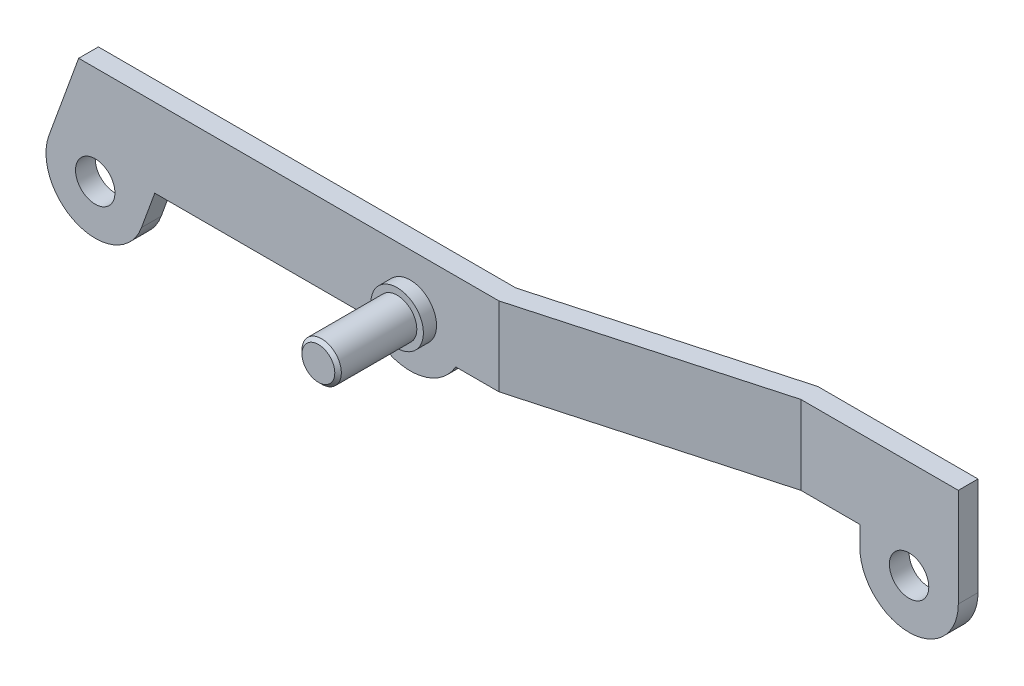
ISO-10303-21;
HEADER;
FILE_DESCRIPTION(('STEP AP214'),'2;1');
FILE_NAME('part.step','',(''),(''),'','','');
FILE_SCHEMA(('AUTOMOTIVE_DESIGN { 1 0 10303 214 1 1 1 1 }'));
ENDSEC;
DATA;
#1=APPLICATION_CONTEXT('core data for automotive mechanical design processes');
#2=APPLICATION_PROTOCOL_DEFINITION('international standard','automotive_design',2000,#1);
#3=PRODUCT_CONTEXT('',#1,'mechanical');
#4=PRODUCT('Part','Part','',(#3));
#5=PRODUCT_RELATED_PRODUCT_CATEGORY('part','',(#4));
#6=PRODUCT_DEFINITION_FORMATION('','',#4);
#7=PRODUCT_DEFINITION_CONTEXT('part definition',#1,'design');
#8=PRODUCT_DEFINITION('design','',#6,#7);
#9=PRODUCT_DEFINITION_SHAPE('','',#8);
#10=(LENGTH_UNIT() NAMED_UNIT(*) SI_UNIT(.MILLI.,.METRE.));
#11=(NAMED_UNIT(*) PLANE_ANGLE_UNIT() SI_UNIT($,.RADIAN.));
#12=(NAMED_UNIT(*) SI_UNIT($,.STERADIAN.) SOLID_ANGLE_UNIT());
#13=UNCERTAINTY_MEASURE_WITH_UNIT(LENGTH_MEASURE(1.E-05),#10,'distance_accuracy_value','');
#14=(GEOMETRIC_REPRESENTATION_CONTEXT(3) GLOBAL_UNCERTAINTY_ASSIGNED_CONTEXT((#13)) GLOBAL_UNIT_ASSIGNED_CONTEXT((#10,
#11,#12)) REPRESENTATION_CONTEXT('',''));
#15=CARTESIAN_POINT('',(0.,0.,0.));
#16=DIRECTION('',(0.,0.,1.));
#17=DIRECTION('',(1.,0.,0.));
#18=AXIS2_PLACEMENT_3D('',#15,#16,#17);
#19=CARTESIAN_POINT('',(0.,0.,1.));
#20=DIRECTION('',(0.,0.,1.));
#21=DIRECTION('',(1.,0.,0.));
#22=AXIS2_PLACEMENT_3D('',#19,#20,#21);
#23=PLANE('',#22);
#24=CARTESIAN_POINT('',(0.,0.,1.));
#25=DIRECTION('',(0.,0.,1.));
#26=DIRECTION('',(1.,0.,0.));
#27=AXIS2_PLACEMENT_3D('',#24,#25,#26);
#28=CIRCLE('',#27,2.);
#29=CARTESIAN_POINT('',(2.,0.,1.));
#30=VERTEX_POINT('',#29);
#31=EDGE_CURVE('E149',#30,#30,#28,.T.);
#32=ORIENTED_EDGE('',*,*,#31,.T.);
#33=EDGE_LOOP('',(#32));
#34=FACE_BOUND('',#33,.T.);
#35=CARTESIAN_POINT('',(0.,0.,1.));
#36=DIRECTION('',(0.,0.,1.));
#37=DIRECTION('',(1.,0.,0.));
#38=AXIS2_PLACEMENT_3D('',#35,#36,#37);
#39=CIRCLE('',#38,1.5);
#40=CARTESIAN_POINT('',(1.5,0.,1.));
#41=VERTEX_POINT('',#40);
#42=EDGE_CURVE('E141',#41,#41,#39,.T.);
#43=ORIENTED_EDGE('',*,*,#42,.F.);
#44=EDGE_LOOP('',(#43));
#45=FACE_BOUND('',#44,.T.);
#46=ADVANCED_FACE('F17',(#34,#45),#23,.T.);
#47=CARTESIAN_POINT('',(-19.463378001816,-2.,-6.5));
#48=DIRECTION('',(0.,-1.,0.));
#49=DIRECTION('',(0.,0.,-1.));
#50=AXIS2_PLACEMENT_3D('',#47,#48,#49);
#51=PLANE('',#50);
#52=DIRECTION('',(0.,0.,1.));
#53=VECTOR('',#52,1.);
#54=CARTESIAN_POINT('',(3.46410161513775,-2.,-10.4442719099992));
#55=LINE('',#54,#53);
#56=CARTESIAN_POINT('',(3.46410161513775,-2.,-1.5));
#57=VERTEX_POINT('',#56);
#58=CARTESIAN_POINT('',(3.46410161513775,-2.,0.));
#59=VERTEX_POINT('',#58);
#60=EDGE_CURVE('E134',#57,#59,#55,.T.);
#61=ORIENTED_EDGE('',*,*,#60,.F.);
#62=DIRECTION('',(1.,0.,0.));
#63=VECTOR('',#62,1.);
#64=CARTESIAN_POINT('',(-19.463378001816,-2.,-1.5));
#65=LINE('',#64,#63);
#66=CARTESIAN_POINT('',(6.54553749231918,-2.,-1.5));
#67=VERTEX_POINT('',#66);
#68=EDGE_CURVE('E125',#57,#67,#65,.T.);
#69=ORIENTED_EDGE('',*,*,#68,.T.);
#70=DIRECTION('',(0.963517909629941,0.,-0.267643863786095));
#71=VECTOR('',#70,1.);
#72=CARTESIAN_POINT('',(-16.3108768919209,-2.,4.84900399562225));
#73=LINE('',#72,#71);
#74=CARTESIAN_POINT('',(24.5455374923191,-2.,-6.5));
#75=VERTEX_POINT('',#74);
#76=EDGE_CURVE('E189',#67,#75,#73,.T.);
#77=ORIENTED_EDGE('',*,*,#76,.T.);
#78=DIRECTION('',(1.,0.,0.));
#79=VECTOR('',#78,1.);
#80=CARTESIAN_POINT('',(-19.463378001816,-2.,-6.5));
#81=LINE('',#80,#79);
#82=CARTESIAN_POINT('',(29.25,-2.,-6.5));
#83=VERTEX_POINT('',#82);
#84=EDGE_CURVE('E212',#75,#83,#81,.T.);
#85=ORIENTED_EDGE('',*,*,#84,.T.);
#86=DIRECTION('',(0.,0.,1.));
#87=VECTOR('',#86,1.);
#88=CARTESIAN_POINT('',(29.25,-2.,-6.5));
#89=LINE('',#88,#87);
#90=CARTESIAN_POINT('',(29.25,-2.,-5.));
#91=VERTEX_POINT('',#90);
#92=EDGE_CURVE('E239',#83,#91,#89,.T.);
#93=ORIENTED_EDGE('',*,*,#92,.T.);
#94=DIRECTION('',(-1.,0.,0.));
#95=VECTOR('',#94,1.);
#96=CARTESIAN_POINT('',(-19.463378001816,-2.,-5.));
#97=LINE('',#96,#95);
#98=CARTESIAN_POINT('',(24.75,-2.,-5.));
#99=VERTEX_POINT('',#98);
#100=EDGE_CURVE('E169',#91,#99,#97,.T.);
#101=ORIENTED_EDGE('',*,*,#100,.T.);
#102=DIRECTION('',(-0.963517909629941,0.,0.267643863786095));
#103=VECTOR('',#102,1.);
#104=CARTESIAN_POINT('',(-15.9094110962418,-2.,6.29428086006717));
#105=LINE('',#104,#103);
#106=CARTESIAN_POINT('',(6.75,-2.,0.));
#107=VERTEX_POINT('',#106);
#108=EDGE_CURVE('E187',#99,#107,#105,.T.);
#109=ORIENTED_EDGE('',*,*,#108,.T.);
#110=DIRECTION('',(1.,0.,0.));
#111=VECTOR('',#110,1.);
#112=CARTESIAN_POINT('',(-19.463378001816,-2.,0.));
#113=LINE('',#112,#111);
#114=EDGE_CURVE('E32',#59,#107,#113,.T.);
#115=ORIENTED_EDGE('',*,*,#114,.F.);
#116=EDGE_LOOP('',(#61,#69,#77,#85,#93,#101,#109,#115));
#117=FACE_BOUND('',#116,.T.);
#118=ADVANCED_FACE('F270',(#117),#51,.T.);
#119=CARTESIAN_POINT('',(-25.2608898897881,4.,-6.5));
#120=DIRECTION('',(-0.939692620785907,0.342020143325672,0.));
#121=DIRECTION('',(-0.342020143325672,-0.939692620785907,0.));
#122=AXIS2_PLACEMENT_3D('',#119,#120,#121);
#123=PLANE('',#122);
#124=DIRECTION('',(0.,0.,1.));
#125=VECTOR('',#124,1.);
#126=CARTESIAN_POINT('',(-25.2608898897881,4.,-6.5));
#127=LINE('',#126,#125);
#128=CARTESIAN_POINT('',(-25.2608898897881,4.,-1.5));
#129=VERTEX_POINT('',#128);
#130=CARTESIAN_POINT('',(-25.2608898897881,4.,0.));
#131=VERTEX_POINT('',#130);
#132=EDGE_CURVE('E227',#129,#131,#127,.T.);
#133=ORIENTED_EDGE('',*,*,#132,.F.);
#134=DIRECTION('',(-0.342020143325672,-0.939692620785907,0.));
#135=VECTOR('',#134,1.);
#136=CARTESIAN_POINT('',(-25.2608898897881,4.,-1.5));
#137=LINE('',#136,#135);
#138=CARTESIAN_POINT('',(-27.5238473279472,-2.21742446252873,-1.5));
#139=VERTEX_POINT('',#138);
#140=EDGE_CURVE('E124',#129,#139,#137,.T.);
#141=ORIENTED_EDGE('',*,*,#140,.T.);
#142=DIRECTION('',(0.,0.,1.));
#143=VECTOR('',#142,1.);
#144=CARTESIAN_POINT('',(-27.5238473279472,-2.21742446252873,-6.5));
#145=LINE('',#144,#143);
#146=CARTESIAN_POINT('',(-27.5238473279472,-2.21742446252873,0.));
#147=VERTEX_POINT('',#146);
#148=EDGE_CURVE('E226',#139,#147,#145,.T.);
#149=ORIENTED_EDGE('',*,*,#148,.T.);
#150=DIRECTION('',(-0.342020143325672,-0.939692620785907,0.));
#151=VECTOR('',#150,1.);
#152=CARTESIAN_POINT('',(-25.2608898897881,4.,0.));
#153=LINE('',#152,#151);
#154=EDGE_CURVE('E198',#131,#147,#153,.T.);
#155=ORIENTED_EDGE('',*,*,#154,.F.);
#156=EDGE_LOOP('',(#133,#141,#149,#155));
#157=FACE_BOUND('',#156,.T.);
#158=ADVANCED_FACE('F19',(#157),#123,.T.);
#159=CARTESIAN_POINT('',(-25.2608898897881,4.,-6.5));
#160=DIRECTION('',(0.,1.,0.));
#161=DIRECTION('',(0.,0.,1.));
#162=AXIS2_PLACEMENT_3D('',#159,#160,#161);
#163=PLANE('',#162);
#164=DIRECTION('',(0.963517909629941,0.,-0.267643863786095));
#165=VECTOR('',#164,1.);
#166=CARTESIAN_POINT('',(24.75,4.,-5.));
#167=LINE('',#166,#165);
#168=CARTESIAN_POINT('',(6.75,4.,0.));
#169=VERTEX_POINT('',#168);
#170=CARTESIAN_POINT('',(24.75,4.,-5.));
#171=VERTEX_POINT('',#170);
#172=EDGE_CURVE('E158',#169,#171,#167,.T.);
#173=ORIENTED_EDGE('',*,*,#172,.T.);
#174=DIRECTION('',(1.,0.,0.));
#175=VECTOR('',#174,1.);
#176=CARTESIAN_POINT('',(41.75,4.,-5.));
#177=LINE('',#176,#175);
#178=CARTESIAN_POINT('',(36.75,4.,-5.));
#179=VERTEX_POINT('',#178);
#180=EDGE_CURVE('E161',#171,#179,#177,.T.);
#181=ORIENTED_EDGE('',*,*,#180,.T.);
#182=DIRECTION('',(0.,0.,1.));
#183=VECTOR('',#182,1.);
#184=CARTESIAN_POINT('',(36.75,4.,-6.5));
#185=LINE('',#184,#183);
#186=CARTESIAN_POINT('',(36.75,4.,-6.5));
#187=VERTEX_POINT('',#186);
#188=EDGE_CURVE('E230',#187,#179,#185,.T.);
#189=ORIENTED_EDGE('',*,*,#188,.F.);
#190=DIRECTION('',(-1.,0.,0.));
#191=VECTOR('',#190,1.);
#192=CARTESIAN_POINT('',(-25.2608898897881,4.,-6.5));
#193=LINE('',#192,#191);
#194=CARTESIAN_POINT('',(24.5455374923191,4.,-6.5));
#195=VERTEX_POINT('',#194);
#196=EDGE_CURVE('E223',#187,#195,#193,.T.);
#197=ORIENTED_EDGE('',*,*,#196,.T.);
#198=DIRECTION('',(-0.963517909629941,0.,0.267643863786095));
#199=VECTOR('',#198,1.);
#200=CARTESIAN_POINT('',(37.1455374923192,4.,-10.));
#201=LINE('',#200,#199);
#202=CARTESIAN_POINT('',(6.54553749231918,4.,-1.5));
#203=VERTEX_POINT('',#202);
#204=EDGE_CURVE('E152',#195,#203,#201,.T.);
#205=ORIENTED_EDGE('',*,*,#204,.T.);
#206=DIRECTION('',(-1.,0.,0.));
#207=VECTOR('',#206,1.);
#208=CARTESIAN_POINT('',(6.54553749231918,4.,-1.5));
#209=LINE('',#208,#207);
#210=EDGE_CURVE('E155',#203,#129,#209,.T.);
#211=ORIENTED_EDGE('',*,*,#210,.T.);
#212=ORIENTED_EDGE('',*,*,#132,.T.);
#213=DIRECTION('',(-1.,0.,0.));
#214=VECTOR('',#213,1.);
#215=CARTESIAN_POINT('',(-25.2608898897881,4.,0.));
#216=LINE('',#215,#214);
#217=EDGE_CURVE('E209',#169,#131,#216,.T.);
#218=ORIENTED_EDGE('',*,*,#217,.F.);
#219=EDGE_LOOP('',(#173,#181,#189,#197,#205,#211,#212,#218));
#220=FACE_BOUND('',#219,.T.);
#221=ADVANCED_FACE('F316',(#220),#163,.T.);
#222=CARTESIAN_POINT('',(36.75,4.,-6.5));
#223=DIRECTION('',(1.,0.,0.));
#224=DIRECTION('',(0.,0.,-1.));
#225=AXIS2_PLACEMENT_3D('',#222,#223,#224);
#226=PLANE('',#225);
#227=ORIENTED_EDGE('',*,*,#188,.T.);
#228=DIRECTION('',(0.,-1.,0.));
#229=VECTOR('',#228,1.);
#230=CARTESIAN_POINT('',(36.75,4.,-5.));
#231=LINE('',#230,#229);
#232=CARTESIAN_POINT('',(36.75,-3.5,-5.));
#233=VERTEX_POINT('',#232);
#234=EDGE_CURVE('E177',#179,#233,#231,.T.);
#235=ORIENTED_EDGE('',*,*,#234,.T.);
#236=DIRECTION('',(0.,0.,1.));
#237=VECTOR('',#236,1.);
#238=CARTESIAN_POINT('',(36.75,-3.5,-6.5));
#239=LINE('',#238,#237);
#240=CARTESIAN_POINT('',(36.75,-3.5,-6.5));
#241=VERTEX_POINT('',#240);
#242=EDGE_CURVE('E233',#241,#233,#239,.T.);
#243=ORIENTED_EDGE('',*,*,#242,.F.);
#244=DIRECTION('',(0.,1.,0.));
#245=VECTOR('',#244,1.);
#246=CARTESIAN_POINT('',(36.75,4.,-6.5));
#247=LINE('',#246,#245);
#248=EDGE_CURVE('E220',#241,#187,#247,.T.);
#249=ORIENTED_EDGE('',*,*,#248,.T.);
#250=EDGE_LOOP('',(#227,#235,#243,#249));
#251=FACE_BOUND('',#250,.T.);
#252=ADVANCED_FACE('F319',(#251),#226,.T.);
#253=CARTESIAN_POINT('',(33.,-3.5,-6.5));
#254=DIRECTION('',(0.,0.,1.));
#255=DIRECTION('',(1.,0.,0.));
#256=AXIS2_PLACEMENT_3D('',#253,#254,#255);
#257=CYLINDRICAL_SURFACE('',#256,3.75);
#258=CARTESIAN_POINT('',(33.,-3.5,-5.));
#259=DIRECTION('',(0.,0.,1.));
#260=DIRECTION('',(1.,0.,0.));
#261=AXIS2_PLACEMENT_3D('',#258,#259,#260);
#262=CIRCLE('',#261,3.75);
#263=CARTESIAN_POINT('',(29.25,-3.5,-5.));
#264=VERTEX_POINT('',#263);
#265=EDGE_CURVE('E175',#233,#264,#262,.F.);
#266=ORIENTED_EDGE('',*,*,#265,.T.);
#267=DIRECTION('',(0.,0.,1.));
#268=VECTOR('',#267,1.);
#269=CARTESIAN_POINT('',(29.25,-3.5,-6.5));
#270=LINE('',#269,#268);
#271=CARTESIAN_POINT('',(29.25,-3.5,-6.5));
#272=VERTEX_POINT('',#271);
#273=EDGE_CURVE('E236',#272,#264,#270,.T.);
#274=ORIENTED_EDGE('',*,*,#273,.F.);
#275=CARTESIAN_POINT('',(33.,-3.5,-6.5));
#276=DIRECTION('',(0.,0.,1.));
#277=DIRECTION('',(1.,0.,0.));
#278=AXIS2_PLACEMENT_3D('',#275,#276,#277);
#279=CIRCLE('',#278,3.75);
#280=EDGE_CURVE('E217',#272,#241,#279,.T.);
#281=ORIENTED_EDGE('',*,*,#280,.T.);
#282=ORIENTED_EDGE('',*,*,#242,.T.);
#283=EDGE_LOOP('',(#266,#274,#281,#282));
#284=FACE_BOUND('',#283,.T.);
#285=ADVANCED_FACE('F323',(#284),#257,.T.);
#286=CARTESIAN_POINT('',(29.25,-2.,-6.5));
#287=DIRECTION('',(-1.,0.,0.));
#288=DIRECTION('',(0.,0.,1.));
#289=AXIS2_PLACEMENT_3D('',#286,#287,#288);
#290=PLANE('',#289);
#291=ORIENTED_EDGE('',*,*,#273,.T.);
#292=DIRECTION('',(0.,1.,0.));
#293=VECTOR('',#292,1.);
#294=CARTESIAN_POINT('',(29.25,-2.,-5.));
#295=LINE('',#294,#293);
#296=EDGE_CURVE('E172',#264,#91,#295,.T.);
#297=ORIENTED_EDGE('',*,*,#296,.T.);
#298=ORIENTED_EDGE('',*,*,#92,.F.);
#299=DIRECTION('',(0.,-1.,0.));
#300=VECTOR('',#299,1.);
#301=CARTESIAN_POINT('',(29.25,-2.,-6.5));
#302=LINE('',#301,#300);
#303=EDGE_CURVE('E214',#83,#272,#302,.T.);
#304=ORIENTED_EDGE('',*,*,#303,.T.);
#305=EDGE_LOOP('',(#291,#297,#298,#304));
#306=FACE_BOUND('',#305,.T.);
#307=ADVANCED_FACE('F327',(#306),#290,.T.);
#308=DIRECTION('',(0.,0.,1.));
#309=VECTOR('',#308,1.);
#310=CARTESIAN_POINT('',(-3.46410161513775,-2.,-10.4442719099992));
#311=LINE('',#310,#309);
#312=CARTESIAN_POINT('',(-3.46410161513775,-2.,0.));
#313=VERTEX_POINT('',#312);
#314=CARTESIAN_POINT('',(-3.46410161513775,-2.,-1.5));
#315=VERTEX_POINT('',#314);
#316=EDGE_CURVE('E40',#313,#315,#311,.F.);
#317=ORIENTED_EDGE('',*,*,#316,.F.);
#318=CARTESIAN_POINT('',(-19.463378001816,-2.,0.));
#319=VERTEX_POINT('',#318);
#320=EDGE_CURVE('E207',#319,#313,#113,.T.);
#321=ORIENTED_EDGE('',*,*,#320,.F.);
#322=DIRECTION('',(0.,0.,1.));
#323=VECTOR('',#322,1.);
#324=CARTESIAN_POINT('',(-19.463378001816,-2.,-6.5));
#325=LINE('',#324,#323);
#326=CARTESIAN_POINT('',(-19.463378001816,-2.,-1.5));
#327=VERTEX_POINT('',#326);
#328=EDGE_CURVE('E119',#327,#319,#325,.T.);
#329=ORIENTED_EDGE('',*,*,#328,.F.);
#330=EDGE_CURVE('E117',#327,#315,#65,.T.);
#331=ORIENTED_EDGE('',*,*,#330,.T.);
#332=EDGE_LOOP('',(#317,#321,#329,#331));
#333=FACE_BOUND('',#332,.T.);
#334=ADVANCED_FACE('F118',(#333),#51,.T.);
#335=CARTESIAN_POINT('',(-19.463378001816,-2.,-6.5));
#336=DIRECTION('',(0.939692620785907,-0.342020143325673,0.));
#337=DIRECTION('',(0.342020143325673,0.939692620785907,0.));
#338=AXIS2_PLACEMENT_3D('',#335,#336,#337);
#339=PLANE('',#338);
#340=DIRECTION('',(0.,0.,1.));
#341=VECTOR('',#340,1.);
#342=CARTESIAN_POINT('',(-20.4761526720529,-4.78257553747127,-6.5));
#343=LINE('',#342,#341);
#344=CARTESIAN_POINT('',(-20.4761526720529,-4.78257553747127,-1.5));
#345=VERTEX_POINT('',#344);
#346=CARTESIAN_POINT('',(-20.4761526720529,-4.78257553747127,0.));
#347=VERTEX_POINT('',#346);
#348=EDGE_CURVE('E243',#345,#347,#343,.T.);
#349=ORIENTED_EDGE('',*,*,#348,.F.);
#350=DIRECTION('',(0.342020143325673,0.939692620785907,0.));
#351=VECTOR('',#350,1.);
#352=CARTESIAN_POINT('',(-19.463378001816,-2.,-1.5));
#353=LINE('',#352,#351);
#354=EDGE_CURVE('E183',#345,#327,#353,.T.);
#355=ORIENTED_EDGE('',*,*,#354,.T.);
#356=ORIENTED_EDGE('',*,*,#328,.T.);
#357=DIRECTION('',(0.342020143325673,0.939692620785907,0.));
#358=VECTOR('',#357,1.);
#359=CARTESIAN_POINT('',(-19.463378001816,-2.,0.));
#360=LINE('',#359,#358);
#361=EDGE_CURVE('E204',#347,#319,#360,.T.);
#362=ORIENTED_EDGE('',*,*,#361,.F.);
#363=EDGE_LOOP('',(#349,#355,#356,#362));
#364=FACE_BOUND('',#363,.T.);
#365=ADVANCED_FACE('F333',(#364),#339,.T.);
#366=CARTESIAN_POINT('',(-24.,-3.5,-6.5));
#367=DIRECTION('',(0.,0.,1.));
#368=DIRECTION('',(1.,0.,0.));
#369=AXIS2_PLACEMENT_3D('',#366,#367,#368);
#370=CYLINDRICAL_SURFACE('',#369,3.75);
#371=CARTESIAN_POINT('',(-24.,-3.5,-1.5));
#372=DIRECTION('',(0.,0.,-1.));
#373=DIRECTION('',(-1.,0.,0.));
#374=AXIS2_PLACEMENT_3D('',#371,#372,#373);
#375=CIRCLE('',#374,3.75);
#376=EDGE_CURVE('E181',#139,#345,#375,.F.);
#377=ORIENTED_EDGE('',*,*,#376,.T.);
#378=ORIENTED_EDGE('',*,*,#348,.T.);
#379=CARTESIAN_POINT('',(-24.,-3.5,0.));
#380=DIRECTION('',(0.,0.,1.));
#381=DIRECTION('',(1.,0.,0.));
#382=AXIS2_PLACEMENT_3D('',#379,#380,#381);
#383=CIRCLE('',#382,3.75);
#384=EDGE_CURVE('E201',#147,#347,#383,.T.);
#385=ORIENTED_EDGE('',*,*,#384,.F.);
#386=ORIENTED_EDGE('',*,*,#148,.F.);
#387=EDGE_LOOP('',(#377,#378,#385,#386));
#388=FACE_BOUND('',#387,.T.);
#389=ADVANCED_FACE('F314',(#388),#370,.T.);
#390=CARTESIAN_POINT('',(-24.,-3.5,-6.5));
#391=DIRECTION('',(0.,0.,1.));
#392=DIRECTION('',(1.,0.,0.));
#393=AXIS2_PLACEMENT_3D('',#390,#391,#392);
#394=PLANE('',#393);
#395=CARTESIAN_POINT('',(33.,-3.5,-6.5));
#396=DIRECTION('',(0.,0.,1.));
#397=DIRECTION('',(1.,0.,0.));
#398=AXIS2_PLACEMENT_3D('',#395,#396,#397);
#399=CIRCLE('',#398,1.5);
#400=CARTESIAN_POINT('',(34.5,-3.5,-6.5));
#401=VERTEX_POINT('',#400);
#402=EDGE_CURVE('E192',#401,#401,#399,.T.);
#403=ORIENTED_EDGE('',*,*,#402,.T.);
#404=EDGE_LOOP('',(#403));
#405=FACE_BOUND('',#404,.T.);
#406=DIRECTION('',(0.,-1.,0.));
#407=VECTOR('',#406,1.);
#408=CARTESIAN_POINT('',(24.5455374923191,-3.5,-6.5));
#409=LINE('',#408,#407);
#410=EDGE_CURVE('E252',#195,#75,#409,.T.);
#411=ORIENTED_EDGE('',*,*,#410,.F.);
#412=ORIENTED_EDGE('',*,*,#196,.F.);
#413=ORIENTED_EDGE('',*,*,#248,.F.);
#414=ORIENTED_EDGE('',*,*,#280,.F.);
#415=ORIENTED_EDGE('',*,*,#303,.F.);
#416=ORIENTED_EDGE('',*,*,#84,.F.);
#417=EDGE_LOOP('',(#411,#412,#413,#414,#415,#416));
#418=FACE_BOUND('',#417,.T.);
#419=ADVANCED_FACE('F310',(#405,#418),#394,.F.);
#420=CARTESIAN_POINT('',(-24.,-3.5,0.));
#421=DIRECTION('',(0.,0.,1.));
#422=DIRECTION('',(1.,0.,0.));
#423=AXIS2_PLACEMENT_3D('',#420,#421,#422);
#424=PLANE('',#423);
#425=CARTESIAN_POINT('',(0.,0.,0.));
#426=DIRECTION('',(0.,0.,1.));
#427=DIRECTION('',(1.,0.,0.));
#428=AXIS2_PLACEMENT_3D('',#425,#426,#427);
#429=CIRCLE('',#428,4.);
#430=EDGE_CURVE('E133',#313,#59,#429,.T.);
#431=ORIENTED_EDGE('',*,*,#430,.T.);
#432=ORIENTED_EDGE('',*,*,#114,.T.);
#433=DIRECTION('',(0.,1.,0.));
#434=VECTOR('',#433,1.);
#435=CARTESIAN_POINT('',(6.75,-3.5,0.));
#436=LINE('',#435,#434);
#437=EDGE_CURVE('E229',#107,#169,#436,.T.);
#438=ORIENTED_EDGE('',*,*,#437,.T.);
#439=ORIENTED_EDGE('',*,*,#217,.T.);
#440=ORIENTED_EDGE('',*,*,#154,.T.);
#441=ORIENTED_EDGE('',*,*,#384,.T.);
#442=ORIENTED_EDGE('',*,*,#361,.T.);
#443=ORIENTED_EDGE('',*,*,#320,.T.);
#444=EDGE_LOOP('',(#431,#432,#438,#439,#440,#441,#442,#443));
#445=FACE_BOUND('',#444,.T.);
#446=CARTESIAN_POINT('',(0.,0.,0.));
#447=DIRECTION('',(0.,0.,1.));
#448=DIRECTION('',(1.,0.,0.));
#449=AXIS2_PLACEMENT_3D('',#446,#447,#448);
#450=CIRCLE('',#449,2.);
#451=CARTESIAN_POINT('',(2.,0.,0.));
#452=VERTEX_POINT('',#451);
#453=EDGE_CURVE('E146',#452,#452,#450,.T.);
#454=ORIENTED_EDGE('',*,*,#453,.F.);
#455=EDGE_LOOP('',(#454));
#456=FACE_BOUND('',#455,.T.);
#457=CARTESIAN_POINT('',(-24.,-3.5,0.));
#458=DIRECTION('',(0.,0.,1.));
#459=DIRECTION('',(1.,0.,0.));
#460=AXIS2_PLACEMENT_3D('',#457,#458,#459);
#461=CIRCLE('',#460,1.5);
#462=CARTESIAN_POINT('',(-22.5,-3.5,0.));
#463=VERTEX_POINT('',#462);
#464=EDGE_CURVE('E195',#463,#463,#461,.T.);
#465=ORIENTED_EDGE('',*,*,#464,.F.);
#466=EDGE_LOOP('',(#465));
#467=FACE_BOUND('',#466,.T.);
#468=ADVANCED_FACE('F306',(#445,#456,#467),#424,.T.);
#469=CARTESIAN_POINT('',(-24.,-3.5,-6.5));
#470=DIRECTION('',(0.,0.,1.));
#471=DIRECTION('',(1.,0.,0.));
#472=AXIS2_PLACEMENT_3D('',#469,#470,#471);
#473=CYLINDRICAL_SURFACE('',#472,1.5);
#474=ORIENTED_EDGE('',*,*,#464,.T.);
#475=EDGE_LOOP('',(#474));
#476=FACE_BOUND('',#475,.T.);
#477=CARTESIAN_POINT('',(-24.,-3.5,-1.5));
#478=DIRECTION('',(0.,0.,-1.));
#479=DIRECTION('',(-1.,0.,0.));
#480=AXIS2_PLACEMENT_3D('',#477,#478,#479);
#481=CIRCLE('',#480,1.5);
#482=CARTESIAN_POINT('',(-25.5,-3.5,-1.5));
#483=VERTEX_POINT('',#482);
#484=EDGE_CURVE('E180',#483,#483,#481,.F.);
#485=ORIENTED_EDGE('',*,*,#484,.F.);
#486=EDGE_LOOP('',(#485));
#487=FACE_BOUND('',#486,.T.);
#488=ADVANCED_FACE('F302',(#476,#487),#473,.F.);
#489=CARTESIAN_POINT('',(33.,-3.5,-6.5));
#490=DIRECTION('',(0.,0.,1.));
#491=DIRECTION('',(1.,0.,0.));
#492=AXIS2_PLACEMENT_3D('',#489,#490,#491);
#493=CYLINDRICAL_SURFACE('',#492,1.5);
#494=ORIENTED_EDGE('',*,*,#402,.F.);
#495=EDGE_LOOP('',(#494));
#496=FACE_BOUND('',#495,.T.);
#497=CARTESIAN_POINT('',(33.,-3.5,-5.));
#498=DIRECTION('',(0.,0.,1.));
#499=DIRECTION('',(1.,0.,0.));
#500=AXIS2_PLACEMENT_3D('',#497,#498,#499);
#501=CIRCLE('',#500,1.5);
#502=CARTESIAN_POINT('',(34.5,-3.5,-5.));
#503=VERTEX_POINT('',#502);
#504=EDGE_CURVE('E167',#503,#503,#501,.F.);
#505=ORIENTED_EDGE('',*,*,#504,.F.);
#506=EDGE_LOOP('',(#505));
#507=FACE_BOUND('',#506,.T.);
#508=ADVANCED_FACE('F290',(#496,#507),#493,.F.);
#509=CARTESIAN_POINT('',(41.75,-7.25,-5.));
#510=DIRECTION('',(0.,0.,1.));
#511=DIRECTION('',(1.,0.,0.));
#512=AXIS2_PLACEMENT_3D('',#509,#510,#511);
#513=PLANE('',#512);
#514=ORIENTED_EDGE('',*,*,#180,.F.);
#515=DIRECTION('',(0.,1.,0.));
#516=VECTOR('',#515,1.);
#517=CARTESIAN_POINT('',(24.75,-7.25,-5.));
#518=LINE('',#517,#516);
#519=EDGE_CURVE('E165',#99,#171,#518,.T.);
#520=ORIENTED_EDGE('',*,*,#519,.F.);
#521=ORIENTED_EDGE('',*,*,#100,.F.);
#522=ORIENTED_EDGE('',*,*,#296,.F.);
#523=ORIENTED_EDGE('',*,*,#265,.F.);
#524=ORIENTED_EDGE('',*,*,#234,.F.);
#525=EDGE_LOOP('',(#514,#520,#521,#522,#523,#524));
#526=FACE_BOUND('',#525,.T.);
#527=ORIENTED_EDGE('',*,*,#504,.T.);
#528=EDGE_LOOP('',(#527));
#529=FACE_BOUND('',#528,.T.);
#530=ADVANCED_FACE('F286',(#526,#529),#513,.T.);
#531=CARTESIAN_POINT('',(24.75,-7.25,-5.));
#532=DIRECTION('',(0.267643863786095,0.,0.963517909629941));
#533=DIRECTION('',(0.963517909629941,0.,-0.267643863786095));
#534=AXIS2_PLACEMENT_3D('',#531,#532,#533);
#535=PLANE('',#534);
#536=ORIENTED_EDGE('',*,*,#519,.T.);
#537=ORIENTED_EDGE('',*,*,#172,.F.);
#538=ORIENTED_EDGE('',*,*,#437,.F.);
#539=ORIENTED_EDGE('',*,*,#108,.F.);
#540=EDGE_LOOP('',(#536,#537,#538,#539));
#541=FACE_BOUND('',#540,.T.);
#542=ADVANCED_FACE('F289',(#541),#535,.T.);
#543=CARTESIAN_POINT('',(6.54553749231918,-7.25,-1.5));
#544=DIRECTION('',(0.,0.,-1.));
#545=DIRECTION('',(-1.,0.,0.));
#546=AXIS2_PLACEMENT_3D('',#543,#544,#545);
#547=PLANE('',#546);
#548=ORIENTED_EDGE('',*,*,#68,.F.);
#549=CARTESIAN_POINT('',(0.,0.,-1.5));
#550=DIRECTION('',(0.,0.,-1.));
#551=DIRECTION('',(-1.,0.,0.));
#552=AXIS2_PLACEMENT_3D('',#549,#550,#551);
#553=CIRCLE('',#552,4.);
#554=EDGE_CURVE('E131',#315,#57,#553,.F.);
#555=ORIENTED_EDGE('',*,*,#554,.F.);
#556=ORIENTED_EDGE('',*,*,#330,.F.);
#557=ORIENTED_EDGE('',*,*,#354,.F.);
#558=ORIENTED_EDGE('',*,*,#376,.F.);
#559=ORIENTED_EDGE('',*,*,#140,.F.);
#560=ORIENTED_EDGE('',*,*,#210,.F.);
#561=DIRECTION('',(0.,1.,0.));
#562=VECTOR('',#561,1.);
#563=CARTESIAN_POINT('',(6.54553749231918,-7.25,-1.5));
#564=LINE('',#563,#562);
#565=EDGE_CURVE('E164',#67,#203,#564,.T.);
#566=ORIENTED_EDGE('',*,*,#565,.F.);
#567=EDGE_LOOP('',(#548,#555,#556,#557,#558,#559,#560,#566));
#568=FACE_BOUND('',#567,.T.);
#569=ORIENTED_EDGE('',*,*,#484,.T.);
#570=EDGE_LOOP('',(#569));
#571=FACE_BOUND('',#570,.T.);
#572=ADVANCED_FACE('F137',(#568,#571),#547,.T.);
#573=CARTESIAN_POINT('',(37.1455374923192,-7.25,-10.));
#574=DIRECTION('',(-0.267643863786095,0.,-0.963517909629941));
#575=DIRECTION('',(-0.963517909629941,0.,0.267643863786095));
#576=AXIS2_PLACEMENT_3D('',#573,#574,#575);
#577=PLANE('',#576);
#578=ORIENTED_EDGE('',*,*,#565,.T.);
#579=ORIENTED_EDGE('',*,*,#204,.F.);
#580=ORIENTED_EDGE('',*,*,#410,.T.);
#581=ORIENTED_EDGE('',*,*,#76,.F.);
#582=EDGE_LOOP('',(#578,#579,#580,#581));
#583=FACE_BOUND('',#582,.T.);
#584=ADVANCED_FACE('F284',(#583),#577,.T.);
#585=CARTESIAN_POINT('',(0.,0.,1.));
#586=DIRECTION('',(0.,0.,-1.));
#587=DIRECTION('',(-1.,0.,0.));
#588=AXIS2_PLACEMENT_3D('',#585,#586,#587);
#589=CYLINDRICAL_SURFACE('',#588,2.);
#590=ORIENTED_EDGE('',*,*,#31,.F.);
#591=EDGE_LOOP('',(#590));
#592=FACE_BOUND('',#591,.T.);
#593=ORIENTED_EDGE('',*,*,#453,.T.);
#594=EDGE_LOOP('',(#593));
#595=FACE_BOUND('',#594,.T.);
#596=ADVANCED_FACE('F281',(#592,#595),#589,.T.);
#597=CARTESIAN_POINT('',(0.,0.,-10.4442719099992));
#598=DIRECTION('',(0.,0.,1.));
#599=DIRECTION('',(1.,0.,0.));
#600=AXIS2_PLACEMENT_3D('',#597,#598,#599);
#601=CYLINDRICAL_SURFACE('',#600,4.);
#602=ORIENTED_EDGE('',*,*,#554,.T.);
#603=ORIENTED_EDGE('',*,*,#60,.T.);
#604=ORIENTED_EDGE('',*,*,#430,.F.);
#605=ORIENTED_EDGE('',*,*,#316,.T.);
#606=EDGE_LOOP('',(#602,#603,#604,#605));
#607=FACE_BOUND('',#606,.T.);
#608=ADVANCED_FACE('F130',(#607),#601,.T.);
#609=CARTESIAN_POINT('',(0.,0.,7.));
#610=DIRECTION('',(0.,0.,-1.));
#611=DIRECTION('',(-1.,0.,0.));
#612=AXIS2_PLACEMENT_3D('',#609,#610,#611);
#613=CYLINDRICAL_SURFACE('',#612,1.5);
#614=CARTESIAN_POINT('',(0.,0.,6.75));
#615=DIRECTION('',(0.,0.,1.));
#616=DIRECTION('',(1.,0.,0.));
#617=AXIS2_PLACEMENT_3D('',#614,#615,#616);
#618=CIRCLE('',#617,1.5);
#619=CARTESIAN_POINT('',(1.5,0.,6.75));
#620=VERTEX_POINT('',#619);
#621=EDGE_CURVE('E11',#620,#620,#618,.F.);
#622=ORIENTED_EDGE('',*,*,#621,.T.);
#623=EDGE_LOOP('',(#622));
#624=FACE_BOUND('',#623,.T.);
#625=ORIENTED_EDGE('',*,*,#42,.T.);
#626=EDGE_LOOP('',(#625));
#627=FACE_BOUND('',#626,.T.);
#628=ADVANCED_FACE('F266',(#624,#627),#613,.T.);
#629=CARTESIAN_POINT('',(0.,0.,7.));
#630=DIRECTION('',(0.,0.,1.));
#631=DIRECTION('',(1.,0.,0.));
#632=AXIS2_PLACEMENT_3D('',#629,#630,#631);
#633=PLANE('',#632);
#634=CARTESIAN_POINT('',(0.,0.,7.));
#635=DIRECTION('',(0.,0.,1.));
#636=DIRECTION('',(1.,0.,0.));
#637=AXIS2_PLACEMENT_3D('',#634,#635,#636);
#638=CIRCLE('',#637,1.25);
#639=CARTESIAN_POINT('',(1.25,0.,7.));
#640=VERTEX_POINT('',#639);
#641=EDGE_CURVE('E25',#640,#640,#638,.T.);
#642=ORIENTED_EDGE('',*,*,#641,.T.);
#643=EDGE_LOOP('',(#642));
#644=FACE_BOUND('',#643,.T.);
#645=ADVANCED_FACE('F256',(#644),#633,.T.);
#646=CARTESIAN_POINT('',(0.,0.,7.));
#647=DIRECTION('',(0.,0.,-1.));
#648=DIRECTION('',(-1.,0.,0.));
#649=AXIS2_PLACEMENT_3D('',#646,#647,#648);
#650=CONICAL_SURFACE('',#649,1.25,0.785398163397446);
#651=ORIENTED_EDGE('',*,*,#621,.F.);
#652=EDGE_LOOP('',(#651));
#653=FACE_BOUND('',#652,.T.);
#654=ORIENTED_EDGE('',*,*,#641,.F.);
#655=EDGE_LOOP('',(#654));
#656=FACE_BOUND('',#655,.T.);
#657=ADVANCED_FACE('F258',(#653,#656),#650,.T.);
#658=CLOSED_SHELL('',(#46,#118,#158,#221,#252,#285,#307,#334,#365,#389,#419,#468,#488,#508,#530,
#542,#572,#584,#596,#608,#628,#645,#657));
#659=MANIFOLD_SOLID_BREP('B1',#658);
#660=ADVANCED_BREP_SHAPE_REPRESENTATION('',(#18,#659),#14);
#661=SHAPE_DEFINITION_REPRESENTATION(#9,#660);
ENDSEC;
END-ISO-10303-21;
